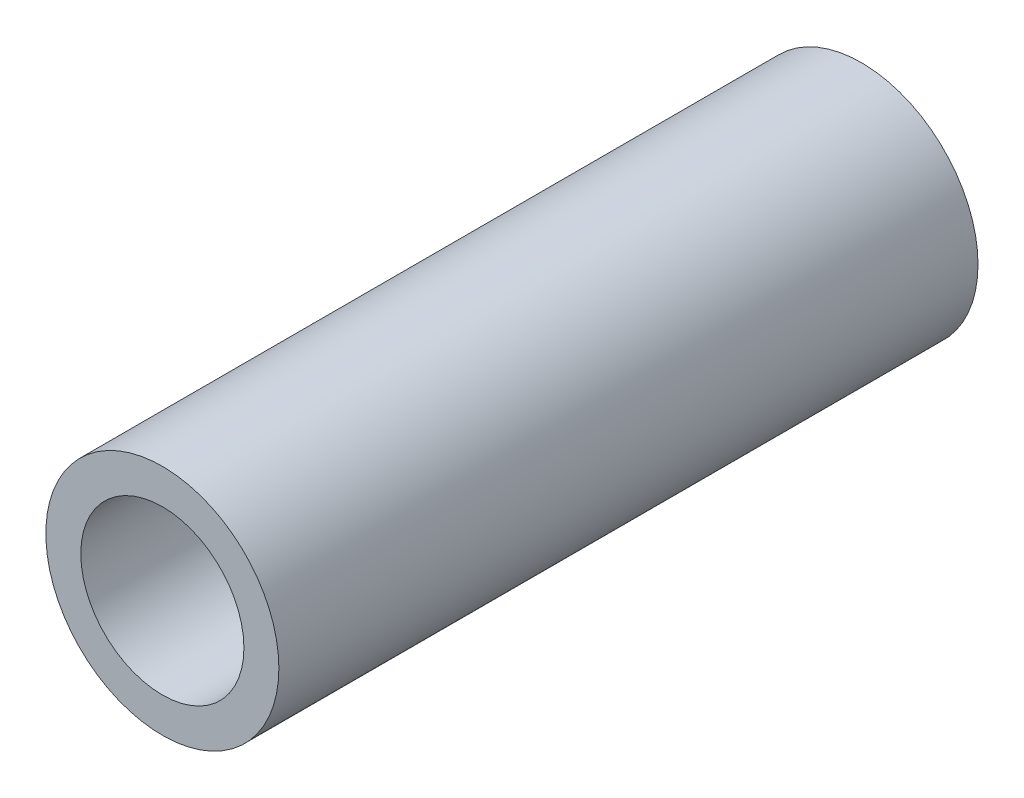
ISO-10303-21;
HEADER;
FILE_DESCRIPTION(('STEP AP214'),'2;1');
FILE_NAME('part.step','',(''),(''),'','','');
FILE_SCHEMA(('AUTOMOTIVE_DESIGN { 1 0 10303 214 1 1 1 1 }'));
ENDSEC;
DATA;
#1=APPLICATION_CONTEXT('core data for automotive mechanical design processes');
#2=APPLICATION_PROTOCOL_DEFINITION('international standard','automotive_design',2000,#1);
#3=PRODUCT_CONTEXT('',#1,'mechanical');
#4=PRODUCT('Part','Part','',(#3));
#5=PRODUCT_RELATED_PRODUCT_CATEGORY('part','',(#4));
#6=PRODUCT_DEFINITION_FORMATION('','',#4);
#7=PRODUCT_DEFINITION_CONTEXT('part definition',#1,'design');
#8=PRODUCT_DEFINITION('design','',#6,#7);
#9=PRODUCT_DEFINITION_SHAPE('','',#8);
#10=(LENGTH_UNIT() NAMED_UNIT(*) SI_UNIT(.MILLI.,.METRE.));
#11=(NAMED_UNIT(*) PLANE_ANGLE_UNIT() SI_UNIT($,.RADIAN.));
#12=(NAMED_UNIT(*) SI_UNIT($,.STERADIAN.) SOLID_ANGLE_UNIT());
#13=UNCERTAINTY_MEASURE_WITH_UNIT(LENGTH_MEASURE(1.E-05),#10,'distance_accuracy_value','');
#14=(GEOMETRIC_REPRESENTATION_CONTEXT(3) GLOBAL_UNCERTAINTY_ASSIGNED_CONTEXT((#13)) GLOBAL_UNIT_ASSIGNED_CONTEXT((#10,
#11,#12)) REPRESENTATION_CONTEXT('',''));
#15=CARTESIAN_POINT('',(0.,0.,0.));
#16=DIRECTION('',(0.,0.,1.));
#17=DIRECTION('',(1.,0.,0.));
#18=AXIS2_PLACEMENT_3D('',#15,#16,#17);
#19=CARTESIAN_POINT('',(0.,0.,60.));
#20=DIRECTION('',(0.,0.,1.));
#21=DIRECTION('',(1.,0.,0.));
#22=AXIS2_PLACEMENT_3D('',#19,#20,#21);
#23=PLANE('',#22);
#24=CARTESIAN_POINT('',(0.,0.,60.));
#25=DIRECTION('',(0.,0.,1.));
#26=DIRECTION('',(1.,0.,0.));
#27=AXIS2_PLACEMENT_3D('',#24,#25,#26);
#28=CIRCLE('',#27,10.);
#29=CARTESIAN_POINT('',(10.,0.,60.));
#30=VERTEX_POINT('',#29);
#31=EDGE_CURVE('E10',#30,#30,#28,.T.);
#32=ORIENTED_EDGE('',*,*,#31,.T.);
#33=EDGE_LOOP('',(#32));
#34=FACE_BOUND('',#33,.T.);
#35=CARTESIAN_POINT('',(0.,0.,60.));
#36=DIRECTION('',(0.,0.,1.));
#37=DIRECTION('',(1.,0.,0.));
#38=AXIS2_PLACEMENT_3D('',#35,#36,#37);
#39=CIRCLE('',#38,7.);
#40=CARTESIAN_POINT('',(7.,0.,60.));
#41=VERTEX_POINT('',#40);
#42=EDGE_CURVE('E42',#41,#41,#39,.T.);
#43=ORIENTED_EDGE('',*,*,#42,.F.);
#44=EDGE_LOOP('',(#43));
#45=FACE_BOUND('',#44,.T.);
#46=ADVANCED_FACE('F31',(#34,#45),#23,.T.);
#47=CARTESIAN_POINT('',(0.,0.,0.));
#48=DIRECTION('',(0.,0.,1.));
#49=DIRECTION('',(1.,0.,0.));
#50=AXIS2_PLACEMENT_3D('',#47,#48,#49);
#51=PLANE('',#50);
#52=CARTESIAN_POINT('',(0.,0.,0.));
#53=DIRECTION('',(0.,0.,1.));
#54=DIRECTION('',(1.,0.,0.));
#55=AXIS2_PLACEMENT_3D('',#52,#53,#54);
#56=CIRCLE('',#55,10.);
#57=CARTESIAN_POINT('',(10.,0.,0.));
#58=VERTEX_POINT('',#57);
#59=EDGE_CURVE('E35',#58,#58,#56,.T.);
#60=ORIENTED_EDGE('',*,*,#59,.F.);
#61=EDGE_LOOP('',(#60));
#62=FACE_BOUND('',#61,.T.);
#63=CARTESIAN_POINT('',(0.,0.,0.));
#64=DIRECTION('',(0.,0.,1.));
#65=DIRECTION('',(1.,0.,0.));
#66=AXIS2_PLACEMENT_3D('',#63,#64,#65);
#67=CIRCLE('',#66,7.);
#68=CARTESIAN_POINT('',(7.,0.,0.));
#69=VERTEX_POINT('',#68);
#70=EDGE_CURVE('E44',#69,#69,#67,.T.);
#71=ORIENTED_EDGE('',*,*,#70,.T.);
#72=EDGE_LOOP('',(#71));
#73=FACE_BOUND('',#72,.T.);
#74=ADVANCED_FACE('F54',(#62,#73),#51,.F.);
#75=CARTESIAN_POINT('',(0.,0.,60.));
#76=DIRECTION('',(0.,0.,-1.));
#77=DIRECTION('',(-1.,0.,0.));
#78=AXIS2_PLACEMENT_3D('',#75,#76,#77);
#79=CYLINDRICAL_SURFACE('',#78,10.);
#80=ORIENTED_EDGE('',*,*,#31,.F.);
#81=EDGE_LOOP('',(#80));
#82=FACE_BOUND('',#81,.T.);
#83=ORIENTED_EDGE('',*,*,#59,.T.);
#84=EDGE_LOOP('',(#83));
#85=FACE_BOUND('',#84,.T.);
#86=ADVANCED_FACE('F33',(#82,#85),#79,.T.);
#87=CARTESIAN_POINT('',(0.,0.,60.));
#88=DIRECTION('',(0.,0.,-1.));
#89=DIRECTION('',(-1.,0.,0.));
#90=AXIS2_PLACEMENT_3D('',#87,#88,#89);
#91=CYLINDRICAL_SURFACE('',#90,7.);
#92=ORIENTED_EDGE('',*,*,#42,.T.);
#93=EDGE_LOOP('',(#92));
#94=FACE_BOUND('',#93,.T.);
#95=ORIENTED_EDGE('',*,*,#70,.F.);
#96=EDGE_LOOP('',(#95));
#97=FACE_BOUND('',#96,.T.);
#98=ADVANCED_FACE('F50',(#94,#97),#91,.F.);
#99=CLOSED_SHELL('',(#46,#74,#86,#98));
#100=MANIFOLD_SOLID_BREP('B2',#99);
#101=ADVANCED_BREP_SHAPE_REPRESENTATION('',(#18,#100),#14);
#102=SHAPE_DEFINITION_REPRESENTATION(#9,#101);
ENDSEC;
END-ISO-10303-21;
